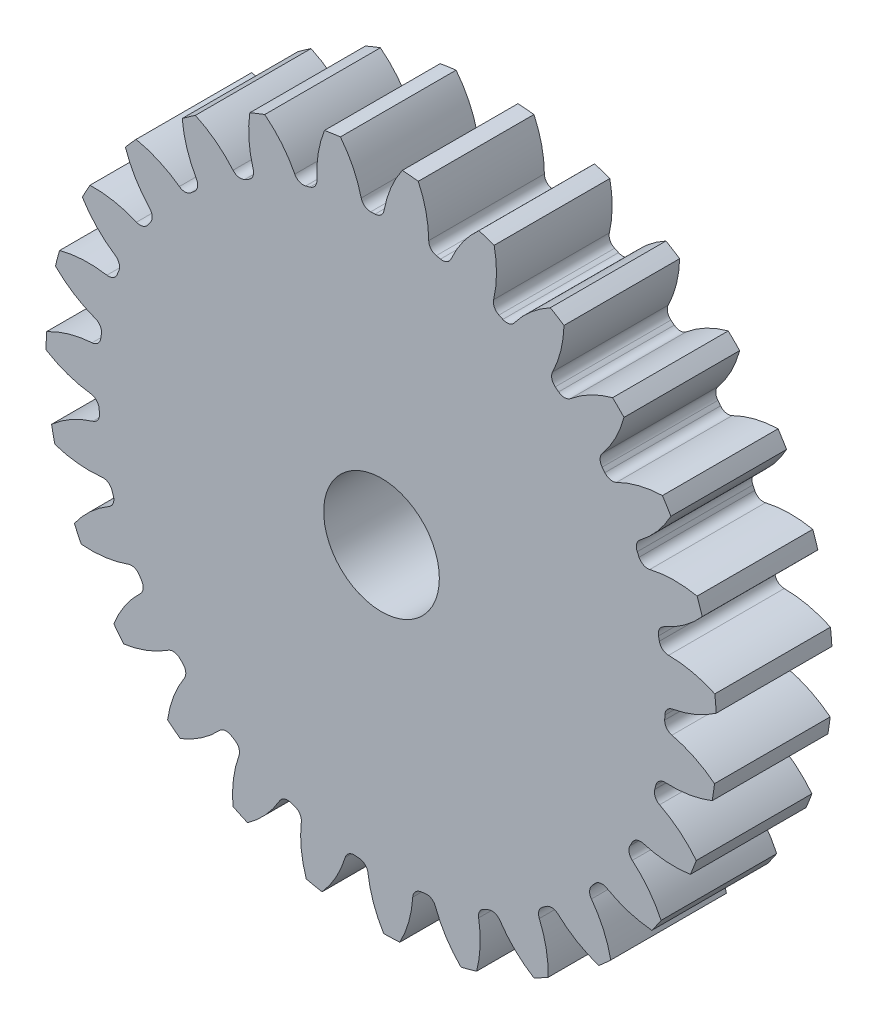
from build123d import *

# Parameters (mm, degrees)
SKETCH3_R         = 294.64
GEARBODY_DEPTH    = 101.6
TOOTHCUT_DEPTH    = 429.891617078
CIRPATTERN1_COUNT = 27
BOREDIA_R         = 50.8
BORE_DEPTH        = 12700


with BuildPart() as part:
    # Sketch3 → gearBody (new body)
    with BuildSketch(Plane.XY):
        Circle(SKETCH3_R)
    extrude(amount=GEARBODY_DEPTH)

    # Sketch2 → toothCut (cut, through all)
    with BuildSketch(Plane.XY):
        with BuildLine():
            ThreePointArc((248.764972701, -8.78377805), (248.824701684, -6.887251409), (248.869972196, -4.990324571))
            ThreePointArc((248.869972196, -4.990324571), (250.839727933, 0.203138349), (255.650713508, 2.979180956))
            ThreePointArc((255.650713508, 2.979180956), (276.053988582, 9.08098109), (294.64, 19.47741212))
            ThreePointArc((294.64, 19.47741212), (295.170034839, -8.170049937), (293.111467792, -35.745861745))
            ThreePointArc((293.111467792, -35.745861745), (275.129001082, -24.337247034), (255.094491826, -17.116164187))
            ThreePointArc((255.094491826, -17.116164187), (250.444431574, -14.078248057), (248.764972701, -8.78377805))
        make_face()
    toothcut = extrude(amount=TOOTHCUT_DEPTH, mode=Mode.SUBTRACT)

    # CirPattern1: toothCut ×27 about axis
    cirpattern1_axis = Axis((0, 0, 0), (0, 0, 1))
    for i in range(1, CIRPATTERN1_COUNT):
        add(toothcut.rotate(cirpattern1_axis, i * 360 / CIRPATTERN1_COUNT), mode=Mode.SUBTRACT)

    # boreDia → bore (cut, symmetric)
    with BuildSketch(Plane.XY):
        Circle(BOREDIA_R)
    extrude(amount=BORE_DEPTH, both=True, mode=Mode.SUBTRACT)


solid = part.part
